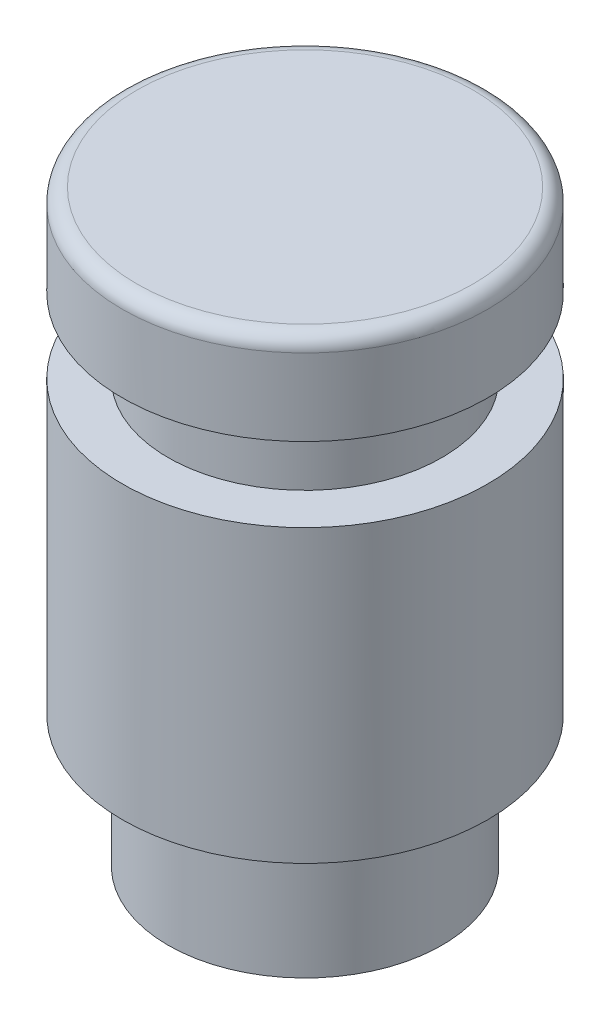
ISO-10303-21;
HEADER;
FILE_DESCRIPTION(('STEP AP214'),'2;1');
FILE_NAME('part.step','',(''),(''),'','','');
FILE_SCHEMA(('AUTOMOTIVE_DESIGN { 1 0 10303 214 1 1 1 1 }'));
ENDSEC;
DATA;
#1=APPLICATION_CONTEXT('core data for automotive mechanical design processes');
#2=APPLICATION_PROTOCOL_DEFINITION('international standard','automotive_design',2000,#1);
#3=PRODUCT_CONTEXT('',#1,'mechanical');
#4=PRODUCT('Part','Part','',(#3));
#5=PRODUCT_RELATED_PRODUCT_CATEGORY('part','',(#4));
#6=PRODUCT_DEFINITION_FORMATION('','',#4);
#7=PRODUCT_DEFINITION_CONTEXT('part definition',#1,'design');
#8=PRODUCT_DEFINITION('design','',#6,#7);
#9=PRODUCT_DEFINITION_SHAPE('','',#8);
#10=(LENGTH_UNIT() NAMED_UNIT(*) SI_UNIT(.MILLI.,.METRE.));
#11=(NAMED_UNIT(*) PLANE_ANGLE_UNIT() SI_UNIT($,.RADIAN.));
#12=(NAMED_UNIT(*) SI_UNIT($,.STERADIAN.) SOLID_ANGLE_UNIT());
#13=UNCERTAINTY_MEASURE_WITH_UNIT(LENGTH_MEASURE(1.E-05),#10,'distance_accuracy_value','');
#14=(GEOMETRIC_REPRESENTATION_CONTEXT(3) GLOBAL_UNCERTAINTY_ASSIGNED_CONTEXT((#13)) GLOBAL_UNIT_ASSIGNED_CONTEXT((#10,
#11,#12)) REPRESENTATION_CONTEXT('',''));
#15=CARTESIAN_POINT('',(0.,0.,0.));
#16=DIRECTION('',(0.,0.,1.));
#17=DIRECTION('',(1.,0.,0.));
#18=AXIS2_PLACEMENT_3D('',#15,#16,#17);
#19=CARTESIAN_POINT('',(0.,0.,0.));
#20=DIRECTION('',(0.,1.,0.));
#21=DIRECTION('',(0.,0.,1.));
#22=AXIS2_PLACEMENT_3D('',#19,#20,#21);
#23=PLANE('',#22);
#24=CARTESIAN_POINT('',(0.,0.,0.));
#25=DIRECTION('',(0.,1.,0.));
#26=DIRECTION('',(0.,0.,1.));
#27=AXIS2_PLACEMENT_3D('',#24,#25,#26);
#28=CIRCLE('',#27,3.175);
#29=CARTESIAN_POINT('',(0.,0.,3.175));
#30=VERTEX_POINT('',#29);
#31=EDGE_CURVE('E48',#30,#30,#28,.T.);
#32=ORIENTED_EDGE('',*,*,#31,.F.);
#33=EDGE_LOOP('',(#32));
#34=FACE_BOUND('',#33,.T.);
#35=CARTESIAN_POINT('',(0.,0.,0.));
#36=DIRECTION('',(0.,1.,0.));
#37=DIRECTION('',(0.,0.,1.));
#38=AXIS2_PLACEMENT_3D('',#35,#36,#37);
#39=CIRCLE('',#38,2.38125);
#40=CARTESIAN_POINT('',(0.,0.,2.38125));
#41=VERTEX_POINT('',#40);
#42=EDGE_CURVE('E44',#41,#41,#39,.F.);
#43=ORIENTED_EDGE('',*,*,#42,.F.);
#44=EDGE_LOOP('',(#43));
#45=FACE_BOUND('',#44,.T.);
#46=ADVANCED_FACE('F33',(#34,#45),#23,.F.);
#47=CARTESIAN_POINT('',(0.,7.9375,0.));
#48=DIRECTION('',(0.,-1.,0.));
#49=DIRECTION('',(0.,0.,-1.));
#50=AXIS2_PLACEMENT_3D('',#47,#48,#49);
#51=CYLINDRICAL_SURFACE('',#50,3.175);
#52=CARTESIAN_POINT('',(0.,5.0546,0.));
#53=DIRECTION('',(0.,-1.,0.));
#54=DIRECTION('',(0.,0.,-1.));
#55=AXIS2_PLACEMENT_3D('',#52,#53,#54);
#56=CIRCLE('',#55,3.175);
#57=CARTESIAN_POINT('',(0.,5.0546,-3.175));
#58=VERTEX_POINT('',#57);
#59=EDGE_CURVE('E53',#58,#58,#56,.T.);
#60=ORIENTED_EDGE('',*,*,#59,.T.);
#61=EDGE_LOOP('',(#60));
#62=FACE_BOUND('',#61,.T.);
#63=ORIENTED_EDGE('',*,*,#31,.T.);
#64=EDGE_LOOP('',(#63));
#65=FACE_BOUND('',#64,.T.);
#66=ADVANCED_FACE('F79',(#62,#65),#51,.T.);
#67=CARTESIAN_POINT('',(0.,5.0546,-3.175));
#68=DIRECTION('',(0.,-1.,0.));
#69=DIRECTION('',(0.,0.,-1.));
#70=AXIS2_PLACEMENT_3D('',#67,#68,#69);
#71=PLANE('',#70);
#72=ORIENTED_EDGE('',*,*,#59,.F.);
#73=EDGE_LOOP('',(#72));
#74=FACE_BOUND('',#73,.T.);
#75=CARTESIAN_POINT('',(0.,5.0546,0.));
#76=DIRECTION('',(0.,-1.,0.));
#77=DIRECTION('',(0.,0.,-1.));
#78=AXIS2_PLACEMENT_3D('',#75,#76,#77);
#79=CIRCLE('',#78,2.38125);
#80=CARTESIAN_POINT('',(0.,5.0546,-2.38125));
#81=VERTEX_POINT('',#80);
#82=EDGE_CURVE('E56',#81,#81,#79,.T.);
#83=ORIENTED_EDGE('',*,*,#82,.T.);
#84=EDGE_LOOP('',(#83));
#85=FACE_BOUND('',#84,.T.);
#86=ADVANCED_FACE('F85',(#74,#85),#71,.F.);
#87=CARTESIAN_POINT('',(0.,0.,0.));
#88=DIRECTION('',(0.,-1.,0.));
#89=DIRECTION('',(0.,0.,-1.));
#90=AXIS2_PLACEMENT_3D('',#87,#88,#89);
#91=CYLINDRICAL_SURFACE('',#90,2.38125);
#92=ORIENTED_EDGE('',*,*,#82,.F.);
#93=EDGE_LOOP('',(#92));
#94=FACE_BOUND('',#93,.T.);
#95=CARTESIAN_POINT('',(0.,6.35,0.));
#96=DIRECTION('',(0.,-1.,0.));
#97=DIRECTION('',(0.,0.,-1.));
#98=AXIS2_PLACEMENT_3D('',#95,#96,#97);
#99=CIRCLE('',#98,2.38125);
#100=CARTESIAN_POINT('',(0.,6.35,-2.38125));
#101=VERTEX_POINT('',#100);
#102=EDGE_CURVE('E59',#101,#101,#99,.T.);
#103=ORIENTED_EDGE('',*,*,#102,.T.);
#104=EDGE_LOOP('',(#103));
#105=FACE_BOUND('',#104,.T.);
#106=ADVANCED_FACE('F100',(#94,#105),#91,.T.);
#107=CARTESIAN_POINT('',(0.,6.35,-3.175));
#108=DIRECTION('',(0.,1.,0.));
#109=DIRECTION('',(0.,0.,1.));
#110=AXIS2_PLACEMENT_3D('',#107,#108,#109);
#111=PLANE('',#110);
#112=ORIENTED_EDGE('',*,*,#102,.F.);
#113=EDGE_LOOP('',(#112));
#114=FACE_BOUND('',#113,.T.);
#115=CARTESIAN_POINT('',(0.,6.35,0.));
#116=DIRECTION('',(0.,-1.,0.));
#117=DIRECTION('',(0.,0.,-1.));
#118=AXIS2_PLACEMENT_3D('',#115,#116,#117);
#119=CIRCLE('',#118,3.175);
#120=CARTESIAN_POINT('',(0.,6.35,-3.175));
#121=VERTEX_POINT('',#120);
#122=EDGE_CURVE('E62',#121,#121,#119,.T.);
#123=ORIENTED_EDGE('',*,*,#122,.T.);
#124=EDGE_LOOP('',(#123));
#125=FACE_BOUND('',#124,.T.);
#126=ADVANCED_FACE('F95',(#114,#125),#111,.F.);
#127=CARTESIAN_POINT('',(0.,7.9375,0.));
#128=DIRECTION('',(0.,1.,0.));
#129=DIRECTION('',(0.,0.,1.));
#130=AXIS2_PLACEMENT_3D('',#127,#128,#129);
#131=PLANE('',#130);
#132=CARTESIAN_POINT('',(0.,7.9375,0.));
#133=DIRECTION('',(0.,1.,0.));
#134=DIRECTION('',(0.,0.,1.));
#135=AXIS2_PLACEMENT_3D('',#132,#133,#134);
#136=CIRCLE('',#135,2.921);
#137=CARTESIAN_POINT('',(0.,7.9375,2.921));
#138=VERTEX_POINT('',#137);
#139=EDGE_CURVE('E40',#138,#138,#136,.T.);
#140=ORIENTED_EDGE('',*,*,#139,.T.);
#141=EDGE_LOOP('',(#140));
#142=FACE_BOUND('',#141,.T.);
#143=ADVANCED_FACE('F89',(#142),#131,.T.);
#144=CARTESIAN_POINT('',(0.,7.6835,0.));
#145=DIRECTION('',(0.,1.,0.));
#146=DIRECTION('',(0.,0.,1.));
#147=AXIS2_PLACEMENT_3D('',#144,#145,#146);
#148=CIRCLE('',#147,3.175);
#149=CARTESIAN_POINT('',(0.,7.6835,3.175));
#150=VERTEX_POINT('',#149);
#151=EDGE_CURVE('E10',#150,#150,#148,.F.);
#152=ORIENTED_EDGE('',*,*,#151,.T.);
#153=EDGE_LOOP('',(#152));
#154=FACE_BOUND('',#153,.T.);
#155=ORIENTED_EDGE('',*,*,#122,.F.);
#156=EDGE_LOOP('',(#155));
#157=FACE_BOUND('',#156,.T.);
#158=ADVANCED_FACE('F74',(#154,#157),#51,.T.);
#159=CARTESIAN_POINT('',(0.,-2.286,0.));
#160=DIRECTION('',(0.,1.,0.));
#161=DIRECTION('',(0.,0.,1.));
#162=AXIS2_PLACEMENT_3D('',#159,#160,#161);
#163=CYLINDRICAL_SURFACE('',#162,2.38125);
#164=CARTESIAN_POINT('',(0.,-2.286,0.));
#165=DIRECTION('',(0.,-1.,0.));
#166=DIRECTION('',(0.,0.,-1.));
#167=AXIS2_PLACEMENT_3D('',#164,#165,#166);
#168=CIRCLE('',#167,2.38125);
#169=CARTESIAN_POINT('',(0.,-2.286,-2.38125));
#170=VERTEX_POINT('',#169);
#171=EDGE_CURVE('E65',#170,#170,#168,.T.);
#172=ORIENTED_EDGE('',*,*,#171,.F.);
#173=EDGE_LOOP('',(#172));
#174=FACE_BOUND('',#173,.T.);
#175=ORIENTED_EDGE('',*,*,#42,.T.);
#176=EDGE_LOOP('',(#175));
#177=FACE_BOUND('',#176,.T.);
#178=ADVANCED_FACE('F71',(#174,#177),#163,.T.);
#179=CARTESIAN_POINT('',(0.,-2.286,0.));
#180=DIRECTION('',(0.,-1.,0.));
#181=DIRECTION('',(0.,0.,-1.));
#182=AXIS2_PLACEMENT_3D('',#179,#180,#181);
#183=PLANE('',#182);
#184=ORIENTED_EDGE('',*,*,#171,.T.);
#185=EDGE_LOOP('',(#184));
#186=FACE_BOUND('',#185,.T.);
#187=ADVANCED_FACE('F69',(#186),#183,.T.);
#188=CARTESIAN_POINT('',(0.,7.6835,0.));
#189=DIRECTION('',(0.,1.,0.));
#190=DIRECTION('',(0.,0.,1.));
#191=AXIS2_PLACEMENT_3D('',#188,#189,#190);
#192=TOROIDAL_SURFACE('',#191,2.921,0.254);
#193=ORIENTED_EDGE('',*,*,#151,.F.);
#194=EDGE_LOOP('',(#193));
#195=FACE_BOUND('',#194,.T.);
#196=ORIENTED_EDGE('',*,*,#139,.F.);
#197=EDGE_LOOP('',(#196));
#198=FACE_BOUND('',#197,.T.);
#199=ADVANCED_FACE('F35',(#195,#198),#192,.T.);
#200=CLOSED_SHELL('',(#46,#66,#86,#106,#126,#143,#158,#178,#187,#199));
#201=MANIFOLD_SOLID_BREP('B2',#200);
#202=ADVANCED_BREP_SHAPE_REPRESENTATION('',(#18,#201),#14);
#203=SHAPE_DEFINITION_REPRESENTATION(#9,#202);
ENDSEC;
END-ISO-10303-21;
